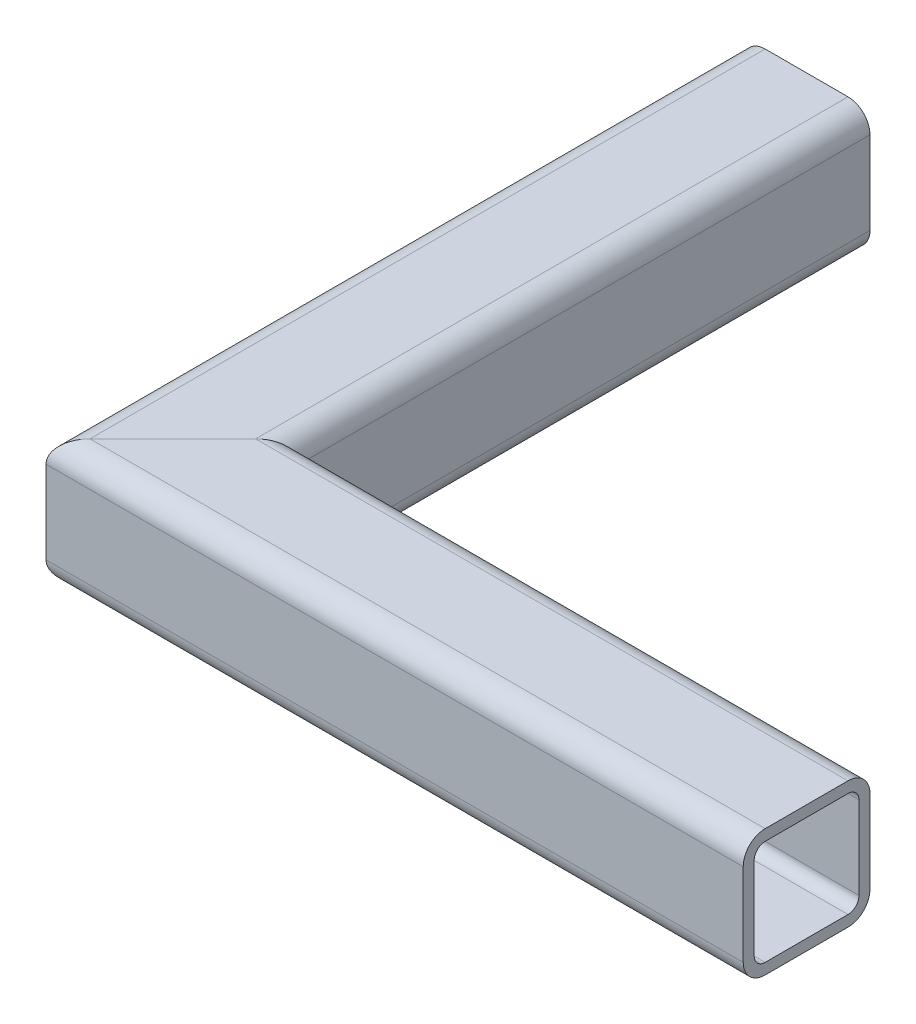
from build123d import *

# Parameters (mm, degrees)
SQUARE_TUBE_30_X_30_X_2_6_1_DEPTH = 150
SQUARE_TUBE_30_X_30_X_2_6_2_DEPTH = 150
BODY_START                        = 150
BODY_2_RUN_ON_DEPTH               = 15
PART_RUN_ON_DEPTH                 = 15


with BuildPart() as part:
    # Sketch115 → Square tube 30 X 30 X 2.6_1 (new body)
    with BuildSketch(Plane(origin=(0, 0, 0), x_dir=(0, 0, -1), z_dir=(1, 0, 0))):
        with BuildLine():
            Line((-9.8, -15), (9.8, -15))
            ThreePointArc((9.8, -15), (13.476955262, -13.476955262), (15, -9.8))
            Line((15, -9.8), (15, 9.8))
            ThreePointArc((15, 9.8), (13.476955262, 13.476955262), (9.8, 15))
            Line((9.8, 15), (-9.8, 15))
            ThreePointArc((-9.8, 15), (-13.476955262, 13.476955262), (-15, 9.8))
            Line((-15, 9.8), (-15, -9.8))
            ThreePointArc((-15, -9.8), (-13.476955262, -13.476955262), (-9.8, -15))
        make_face()
        with BuildLine():
            Line((-9.8, -12.4), (9.8, -12.4))
            ThreePointArc((9.8, -12.4), (11.638477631, -11.638477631), (12.4, -9.8))
            Line((12.4, -9.8), (12.4, 9.8))
            ThreePointArc((12.4, 9.8), (11.638477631, 11.638477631), (9.8, 12.4))
            Line((9.8, 12.4), (-9.8, 12.4))
            ThreePointArc((-9.8, 12.4), (-11.638477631, 11.638477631), (-12.4, 9.8))
            Line((-12.4, 9.8), (-12.4, -9.8))
            ThreePointArc((-12.4, -9.8), (-11.638477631, -11.638477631), (-9.8, -12.4))
        make_face(mode=Mode.SUBTRACT)
    extrude(amount=SQUARE_TUBE_30_X_30_X_2_6_1_DEPTH)

    # Sketch115 → part run on (add)
    with BuildSketch(Plane(origin=(0, 0, 0), x_dir=(0, 0, -1), z_dir=(1, 0, 0))):
        with BuildLine():
            Line((-9.8, -15), (9.8, -15))
            ThreePointArc((9.8, -15), (13.476955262, -13.476955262), (15, -9.8))
            Line((15, -9.8), (15, 9.8))
            ThreePointArc((15, 9.8), (13.476955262, 13.476955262), (9.8, 15))
            Line((9.8, 15), (-9.8, 15))
            ThreePointArc((-9.8, 15), (-13.476955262, 13.476955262), (-15, 9.8))
            Line((-15, 9.8), (-15, -9.8))
            ThreePointArc((-15, -9.8), (-13.476955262, -13.476955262), (-9.8, -15))
        make_face()
        with BuildLine():
            Line((-9.8, -12.4), (9.8, -12.4))
            ThreePointArc((9.8, -12.4), (11.638477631, -11.638477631), (12.4, -9.8))
            Line((12.4, -9.8), (12.4, 9.8))
            ThreePointArc((12.4, 9.8), (11.638477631, 11.638477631), (9.8, 12.4))
            Line((9.8, 12.4), (-9.8, 12.4))
            ThreePointArc((-9.8, 12.4), (-11.638477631, 11.638477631), (-12.4, 9.8))
            Line((-12.4, 9.8), (-12.4, -9.8))
            ThreePointArc((-12.4, -9.8), (-11.638477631, -11.638477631), (-9.8, -12.4))
        make_face(mode=Mode.SUBTRACT)
    extrude(amount=-PART_RUN_ON_DEPTH)

    # Trim_Extend1
    split(bisect_by=Plane(origin=(0, 0, 0), x_dir=(0, 1, 0), z_dir=(0.707106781, 0, 0.707106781)), keep=Keep.TOP)


with BuildPart() as body_2:
    # Sketch117 → Square tube 30 X 30 X 2.6_2 (new body)
    with BuildSketch(Plane.XY.offset(-150)):
        with BuildLine():
            Line((-9.8, -15), (9.8, -15))
            ThreePointArc((9.8, -15), (13.476955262, -13.476955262), (15, -9.8))
            Line((15, -9.8), (15, 9.8))
            ThreePointArc((15, 9.8), (13.476955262, 13.476955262), (9.8, 15))
            Line((9.8, 15), (-9.8, 15))
            ThreePointArc((-9.8, 15), (-13.476955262, 13.476955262), (-15, 9.8))
            Line((-15, 9.8), (-15, -9.8))
            ThreePointArc((-15, -9.8), (-13.476955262, -13.476955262), (-9.8, -15))
        make_face()
        with BuildLine():
            Line((-9.8, -12.4), (9.8, -12.4))
            ThreePointArc((9.8, -12.4), (11.638477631, -11.638477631), (12.4, -9.8))
            Line((12.4, -9.8), (12.4, 9.8))
            ThreePointArc((12.4, 9.8), (11.638477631, 11.638477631), (9.8, 12.4))
            Line((9.8, 12.4), (-9.8, 12.4))
            ThreePointArc((-9.8, 12.4), (-11.638477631, 11.638477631), (-12.4, 9.8))
            Line((-12.4, 9.8), (-12.4, -9.8))
            ThreePointArc((-12.4, -9.8), (-11.638477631, -11.638477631), (-9.8, -12.4))
        make_face(mode=Mode.SUBTRACT)
    extrude(amount=SQUARE_TUBE_30_X_30_X_2_6_2_DEPTH)

    # Sketch117 → body 2 run on (add)
    with BuildSketch(Plane.XY.offset(-150).offset(BODY_START)):
        with BuildLine():
            Line((-9.8, -15), (9.8, -15))
            ThreePointArc((9.8, -15), (13.476955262, -13.476955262), (15, -9.8))
            Line((15, -9.8), (15, 9.8))
            ThreePointArc((15, 9.8), (13.476955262, 13.476955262), (9.8, 15))
            Line((9.8, 15), (-9.8, 15))
            ThreePointArc((-9.8, 15), (-13.476955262, 13.476955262), (-15, 9.8))
            Line((-15, 9.8), (-15, -9.8))
            ThreePointArc((-15, -9.8), (-13.476955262, -13.476955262), (-9.8, -15))
        make_face()
        with BuildLine():
            Line((-9.8, -12.4), (9.8, -12.4))
            ThreePointArc((9.8, -12.4), (11.638477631, -11.638477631), (12.4, -9.8))
            Line((12.4, -9.8), (12.4, 9.8))
            ThreePointArc((12.4, 9.8), (11.638477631, 11.638477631), (9.8, 12.4))
            Line((9.8, 12.4), (-9.8, 12.4))
            ThreePointArc((-9.8, 12.4), (-11.638477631, 11.638477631), (-12.4, 9.8))
            Line((-12.4, 9.8), (-12.4, -9.8))
            ThreePointArc((-12.4, -9.8), (-11.638477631, -11.638477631), (-9.8, -12.4))
        make_face(mode=Mode.SUBTRACT)
    extrude(amount=BODY_2_RUN_ON_DEPTH)

    # Trim_Extend1
    split(bisect_by=Plane(origin=(0, 0, 0), x_dir=(0, -1, 0), z_dir=(-0.707106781, 0, -0.707106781)), keep=Keep.TOP)


solid = Compound([part.part, body_2.part])
